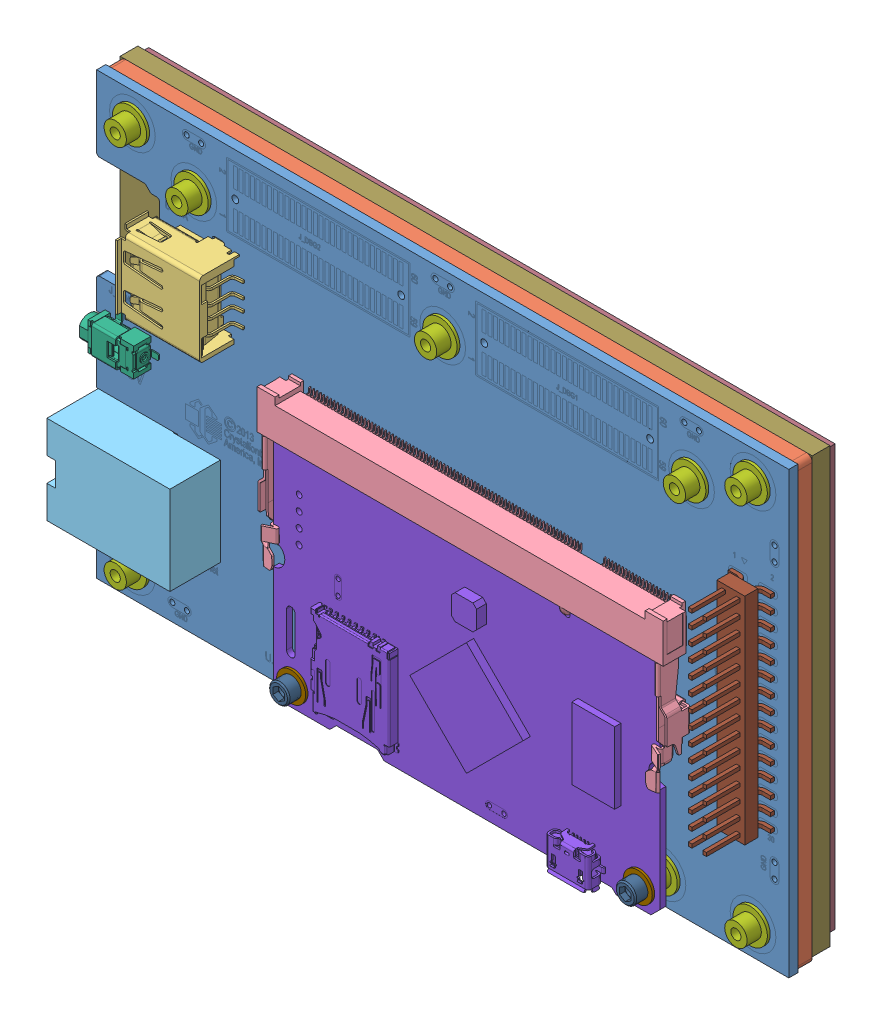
SolidWorks assembly CFA921_ASSY.SLDASM, configuration Default (file format 6000). Lengths in mm.
Overall size (121 77 18.23).
24 component instances, 13 part files, 54 mates.
Components (placement in the parent):
- cfa10058_pcb-1: cfa10058_pcb.SLDPRT [Default] at origin size (121 77 1.6)
- CFPN_01883_rubber_spacer-1: CFPN_01883_rubber_spacer.SLDPRT [Default] at (0 0 -2.5) size (121 77 2.5)
- 875832010blf-1: 875832010blf.SLDPRT [Default] at (-35.5 16.0095 8.288) x (0 1 0) z (1 0 0) size (14.5 10.32 14.91)
- c-1565917-4-d1-3d_sodimm_slot-1: c-1565917-4-d1-3d_sodimm_slot.SLDPRT [Default] at (8.25 2.4 4.32) x (1 0 0) z (0 -1 0) size (71.5 6.18 26.56)
- ethernet_jack-1: ethernet_jack.SLDPRT [Default] at (-49.6 -25.75 5.6002) x (-1 0 0) z (0 1 0) size (21.5 11.35 15.5)
- PJ-038-SMT_power_connector-1: PJ-038-SMT_power_connector.SLDPRT [Default] at (-58.9155 0 1.7) x (0 -1 0) z (-1 0 0) size (7.41 4 10.9)
- CFPN_01712-1: CFPN_01712.SLDPRT [Default] at (-54.25 -34 4.5999) x (-0.923728 -0.383049 0) z (0 0 -1) size (6 6 4.5)
- CFPN_01712-2: CFPN_01712.SLDPRT [Default] at (-43.5 28 4.5999) x (-0.923728 -0.383049 0) z (0 0 -1) size (6 6 4.5)
- CFPN_01712-3: CFPN_01712.SLDPRT [Default] at (54.25 33 4.5999) x (-0.923728 -0.383049 0) z (0 0 -1) size (6 6 4.5)
- CFPN_01712-4: CFPN_01712.SLDPRT [Default] at (43.5 28 4.5999) x (-0.923728 -0.383049 0) z (0 0 -1) size (6 6 4.5)
- CFPN_01712-5: CFPN_01712.SLDPRT [Default] at (0 28 4.5999) x (-0.923728 -0.383049 0) z (0 0 -1) size (6 6 4.5)
- CFPN_01712-6: CFPN_01712.SLDPRT [Default] at (-22 -34 4.5999) x (-0.923728 -0.383049 0) z (0 0 -1) size (6 6 4.5)
- CFPN_01712-7: CFPN_01712.SLDPRT [Default] at (54.25 -34 4.5999) x (-0.921184 -0.389128 0) z (0 0 -1) size (6 6 4.5)
- CFPN_01712-8: CFPN_01712.SLDPRT [Default] at (38.5 -34 4.5999) x (-0.992309 -0.123782 0) z (0 0 -1) size (6 6 4.5)
- CFPN_01712-9: CFPN_01712.SLDPRT [Default] at (-54.25 33 4.5999) x (-0.923728 -0.383049 0) z (0 0 -1) size (6 6 4.5)
- cfa10036-1: cfa10036.SLDPRT [Default] at (8.2 4.25 5.5999) x (-1 0 0) z (0 0 1) size (67.6 41.75 3.74)
- internal tooth-lock washers_ai-1: internal tooth-lock washers_ai.sldprt [Internal Tooth LW Type A-0.086] at (-22.1 -34 5.5999) x (1 0 0) z (0 -1 0) size (5.08 0.41 5.08)
- internal tooth-lock washers_ai-2: internal tooth-lock washers_ai.sldprt [Internal Tooth LW Type A-0.086] at (38.5 -34 5.5999) x (1 0 0) z (0 -1 0) size (5.08 0.41 5.08)
- socket head cap screw_ai-1: socket head cap screw_ai.sldprt [HX-SHCS 0.086-56x0.188x0.188-S] at (38.5 -34 8.1907) x (0 0 -1) z (1 0 0) size (6.96 3.56 3.56)
- socket head cap screw_ai-2: socket head cap screw_ai.sldprt [HX-SHCS 0.086-56x0.188x0.188-S] at (-22.1 -34 8.1907) x (0 0 -1) z (1 0 0) size (6.96 3.56 3.56)
- c-2-146134-1-n-3d_J_EXP_RE-MODELED-1: c-2-146134-1-n-3d_J_EXP_RE-MODELED.SLDPRT [Default] at (54.25 0.0001 5.4861) x (0 -1 0) z (0 0 -1) size (37.69 7.42 9.73)
- TFT_module-1: TFT_module.SLDASM [Default] at (43.3538 -65.1673 89.6451) x (-1 0 0) z (0 0 -1) size (121 75.85 4.4)
  - TFT_minus_touch_panel-1: TFT_minus_touch_panel.SLDPRT [Default] at (43.3538 65.2423 92.1451) size (121 75.85 3.1)
  - TFT_touch_panel-1: TFT_touch_panel.SLDPRT [Default] at (43.2538 65.8373 95.3451) size (120 73.5 1.2)
Mates (geometry in assembly coordinates):
- Coincident1: coincident aligned: plane of cfa10058_pcb-1 through (60.5 38 1.6) normal (0 1 0); plane of CFPN_01883_rubber_spacer-1 through (59.5 38 0) normal (0 1 0)
- Coincident2: coincident aligned: plane of cfa10058_pcb-1 through (-60.5 38 1.6) normal (-1 0 0); plane of CFPN_01883_rubber_spacer-1 through (-60.5 37 0) normal (-1 0 0)
- Coincident3: coincident anti-aligned: plane of cfa10058_pcb-1 through (-60 25.5 0) normal (0 0 -1); plane of CFPN_01883_rubber_spacer-1 through (59.5 37 0) normal (0 0 1)
- Coincident4: coincident anti-aligned: plane of cfa10058_pcb-1 through (-60 25.5 1.6) normal (0 0 1); plane of 875832010blf-1 through (-45.46 21.5095 1.6) normal (0 0 -1)
- Parallel1: parallel: line of cfa10058_pcb-1 through (60.5 -39 0) axis (0 1 0); plane of 875832010blf-1 through (-35.5 16.0095 8.288) normal (1 0 0)
- Coincident6: coincident aligned: plane of cfa10058_pcb-1 through (-49.5 23.5 1.6) normal (-1 0 0); plane of 875832010blf-1 through (-49.5 10.3995 2.868) normal (-1 0 0)
- Concentric1: concentric aligned: cylinder of cfa10058_pcb-1 through (41.65 4.25 1.6) axis (0 0 -1) radius 0.8; cylinder of c-1565917-4-d1-3d_sodimm_slot-1 through (41.65 4.25 1.6) axis (0 0 -1) radius 0.675
- Concentric2: concentric aligned: cylinder of cfa10058_pcb-1 through (-25.15 4.25 1.6) axis (0 0 -1) radius 0.55; cylinder of c-1565917-4-d1-3d_sodimm_slot-1 through (-25.15 4.25 1.6) axis (0 0 -1) radius 0.425
- Coincident7: coincident anti-aligned: plane of cfa10058_pcb-1 through (-60 25.5 1.6) normal (0 0 1); plane of c-1565917-4-d1-3d_sodimm_slot-1 through (-27.25 2.4 1.6) normal (0 0 -1)
- Parallel2: parallel aligned: plane of cfa10058_pcb-1 through (-60.5 -1.5 1.6) normal (-1 0 0); plane of ethernet_jack-1 through (-60.35 -10.25 10.45) normal (-1 0 0)
- Parallel3: parallel aligned: plane of cfa10058_pcb-1 through (-60 25.5 0) normal (0 0 -1); plane of ethernet_jack-1 through (-60.35 -10.25 -0.9) normal (0 0 -1)
- Concentric4: concentric anti-aligned: cylinder of cfa10058_pcb-1 through (-42.15 -14.5 1.6) axis (0 0 -1) radius 0.71; cylinder of ethernet_jack-1 through (-42.15 -14.5 0) axis (0 0 1) radius 0.55
- Coincident8: coincident anti-aligned: plane of cfa10058_pcb-1 through (-60 25.5 1.6) normal (0 0 1); plane of ethernet_jack-1 through (-47.15 -10.25 1.6) normal (0 0 -1)
- Parallel4: parallel aligned: plane of cfa10058_pcb-1 through (-60 25.5 1.6) normal (0 0 1); plane of PJ-038-SMT_power_connector-1 through (-53.7655 -2.24 5) normal (0 0 1)
- Parallel5: parallel anti-aligned: plane of cfa10058_pcb-1 through (-60.5 6.5 1.6) normal (-1 0 0); plane of PJ-038-SMT_power_connector-1 through (-50.9155 2.5 4.7) normal (1 0 0)
- Concentric5: concentric anti-aligned: cylinder of cfa10058_pcb-1 through (-52.9155 0 1.6) axis (0 0 -1) radius 0.65; cylinder of PJ-038-SMT_power_connector-1 through (-52.9155 0 1.7) axis (0 0 1) radius 0.6
- Coincident10: coincident anti-aligned: plane of cfa10058_pcb-1 through (-60 25.5 1.6) normal (0 0 1); plane of PJ-038-SMT_power_connector-1 through (-56.9155 2.17 1.6) normal (0 0 -1)
- Concentric6: concentric aligned: cylinder of cfa10058_pcb-1 through (-54.25 -34 1.6) axis (0 0 -1) radius 2.075; cylinder of CFPN_01712-1 through (-54.25 -34 1.5999) axis (0 0 -1) radius 1.95
- Coincident11: coincident anti-aligned: plane of cfa10058_pcb-1 through (-54.25 -34 1.5999) normal (0 0 1); plane of CFPN_01712-1 through (-54.25 -34 1.5999) normal (0 0 -1)
- Concentric7: concentric aligned: cylinder of cfa10058_pcb-1 through (-22 -34 1.6) axis (0 0 -1) radius 2.075; cylinder of CFPN_01712-6 through (-22 -34 1.5999) axis (0 0 -1) radius 1.95
- Coincident12: coincident anti-aligned: plane of cfa10058_pcb-1 through (-22 -34 1.5999) normal (0 0 1); plane of CFPN_01712-6 through (-22 -34 1.5999) normal (0 0 -1)
- Concentric8: concentric aligned: cylinder of cfa10058_pcb-1 through (38.5 -34 1.6) axis (0 0 -1) radius 2.075; cylinder of CFPN_01712-8 through (38.5 -34 1.5999) axis (0 0 -1) radius 1.95
- Coincident13: coincident anti-aligned: plane of cfa10058_pcb-1 through (38.5 -34 1.5999) normal (0 0 1); plane of CFPN_01712-8 through (38.5 -34 1.5999) normal (0 0 -1)
- Concentric9: concentric aligned: cylinder of cfa10058_pcb-1 through (54.25 -34 1.6) axis (0 0 -1) radius 2.075; cylinder of CFPN_01712-7 through (54.25 -34 1.5999) axis (0 0 -1) radius 1.95
- Coincident14: coincident anti-aligned: plane of cfa10058_pcb-1 through (54.25 -34 1.5999) normal (0 0 1); plane of CFPN_01712-7 through (54.25 -34 1.5999) normal (0 0 -1)
- Concentric10: concentric aligned: cylinder of cfa10058_pcb-1 through (-54.25 33 1.6) axis (0 0 -1) radius 2.075; cylinder of CFPN_01712-9 through (-54.25 33 1.5999) axis (0 0 -1) radius 1.95
- Coincident15: coincident anti-aligned: plane of cfa10058_pcb-1 through (-54.25 33 1.5999) normal (0 0 1); plane of CFPN_01712-9 through (-54.25 33 1.5999) normal (0 0 -1)
- Concentric11: concentric aligned: cylinder of cfa10058_pcb-1 through (-43.5 28 1.6) axis (0 0 -1) radius 2.075; cylinder of CFPN_01712-2 through (-43.5 28 1.5999) axis (0 0 -1) radius 1.95
- Concentric12: concentric aligned: cylinder of cfa10058_pcb-1 through (0 28 1.6) axis (0 0 -1) radius 2.075; cylinder of CFPN_01712-5 through (0 28 1.5999) axis (0 0 -1) radius 1.95
- Concentric13: concentric aligned: cylinder of cfa10058_pcb-1 through (43.5 28 1.6) axis (0 0 -1) radius 2.075; cylinder of CFPN_01712-4 through (43.5 28 1.5999) axis (0 0 -1) radius 1.95
- Concentric14: concentric aligned: cylinder of cfa10058_pcb-1 through (54.25 33 1.6) axis (0 0 -1) radius 2.075; cylinder of CFPN_01712-3 through (54.25 33 1.5999) axis (0 0 -1) radius 1.95
- Coincident16: coincident anti-aligned: plane of cfa10058_pcb-1 through (-43.5 28 1.5999) normal (0 0 1); plane of CFPN_01712-2 through (-43.5 28 1.5999) normal (0 0 -1)
- Coincident17: coincident anti-aligned: plane of cfa10058_pcb-1 through (0 28 1.5999) normal (0 0 1); plane of CFPN_01712-5 through (0 28 1.5999) normal (0 0 -1)
- Coincident18: coincident anti-aligned: plane of cfa10058_pcb-1 through (43.5 28 1.5999) normal (0 0 1); plane of CFPN_01712-4 through (43.5 28 1.5999) normal (0 0 -1)
- Coincident19: coincident anti-aligned: plane of cfa10058_pcb-1 through (54.25 33 1.5999) normal (0 0 1); plane of CFPN_01712-3 through (54.25 33 1.5999) normal (0 0 -1)
- Parallel6: parallel aligned: plane of cfa10036-1 through (-25.6 4.25 4.5999) normal (0 1 0); plane of c-1565917-4-d1-3d_sodimm_slot-1 through (-24.1 7.95 6.8) normal (0 1 0)
- Coincident20: coincident anti-aligned: plane of c-1565917-4-d1-3d_sodimm_slot-1 through (8.25 4.25 4.32) normal (0 -1 0); plane of cfa10036-1 through (-25.6 4.25 4.5999) normal (0 1 0)
- Concentric15: concentric aligned: cylinder of CFPN_01712-8 through (38.5 -34 4.5999) axis (0 0 1) radius 0.889; cylinder of cfa10036-1 through (38.5 -34 4.5999) axis (0 0 1) radius 1
- Coincident21: coincident anti-aligned: plane of CFPN_01712-8 through (38.5 -34 4.5999) normal (0 0 1); plane of cfa10036-1 through (-25.6 -15.75 4.5999) normal (0 0 -1)
- Concentric16: concentric anti-aligned: cylinder of cfa10036-1 through (-22.1 -34 4.5999) axis (0 0 1) radius 1; cylinder of internal tooth-lock washers_ai-1 through (-22.1 -34 6.0063) axis (0 0 -1) radius 2.54
- Coincident22: coincident anti-aligned: plane of cfa10036-1 through (-25.6 -15.75 5.5999) normal (0 0 1); plane of internal tooth-lock washers_ai-1 through (-22.1 -34 5.5999) normal (0 0 -1)
- Coincident23: coincident anti-aligned: plane of cfa10036-1 through (-25.6 -15.75 5.5999) normal (0 0 1); plane of internal tooth-lock washers_ai-2 through (38.5 -34 5.5999) normal (0 0 -1)
- Concentric17: concentric aligned: circle of cfa10036-1; circle of internal tooth-lock washers_ai-2
- Concentric18: concentric aligned: cylinder of cfa10036-1 through (-22.1 -34 4.5999) axis (0 0 1) radius 1; cylinder of socket head cap screw_ai-2 through (-22.1 -34 39.9407) axis (0 0 1) radius 1.778
- Concentric19: concentric aligned: cylinder of cfa10036-1 through (38.5 -34 4.5999) axis (0 0 1) radius 1; cylinder of socket head cap screw_ai-1 through (38.5 -34 39.9407) axis (0 0 1) radius 1.778
- Coincident24: coincident aligned: plane of internal tooth-lock washers_ai-1 through (-22.1 -34 6.0063) normal (0 0 1); circle of socket head cap screw_ai-2
- Coincident25: coincident anti-aligned: plane of internal tooth-lock washers_ai-2 through (38.5 -34 6.0063) normal (0 0 1); plane of socket head cap screw_ai-1 through (38.5 -32.222 6.0063) normal (0 0 -1)
- Coincident26: coincident anti-aligned: plane of cfa10058_pcb-1 through (57.9965 17.907 1.5999) normal (0 0 1); plane of c-2-146134-1-n-3d_J_EXP_RE-MODELED-1 through (50.5416 -18.0975 1.5999) normal (0 0 -1)
- Parallel7: parallel aligned: plane of cfa10058_pcb-1 through (60.5 38 1.6) normal (0 1 0); plane of c-2-146134-1-n-3d_J_EXP_RE-MODELED-1 through (51.8116 18.8469 3.2001) normal (0 1 0)
- Distance1: distance = 0.5461 mm: line of cfa10058_pcb-1 through (58.5045 17.653 1.6) axis (0 1 0); plane of c-2-146134-1-n-3d_J_EXP_RE-MODELED-1 through (57.9584 17.4625 2.2349) normal (1 0 0)
- Distance2: distance = 0.3175 mm: plane of c-2-146134-1-n-3d_J_EXP_RE-MODELED-1 through (56.4725 -18.0975 2.8699) normal (0 -1 0); line of cfa10058_pcb-1 through (55.7105 -18.415 1.6) axis (1 0 0)
- Coincident28: coincident anti-aligned: plane of CFPN_01883_rubber_spacer-1 through (59.5 37 -2.5) normal (0 0 -1); plane of TFT_module-1/TFT_minus_touch_panel-1 through (0 0.075 -2.5) normal (0 0 1)
- Coincident29: coincident: line of cfa10058_pcb-1 through (60.5 38 0) axis (-1 0 0); plane of TFT_module-1/TFT_minus_touch_panel-1 through (60.5 38 -5.6) normal (0 1 0)
- Coincident30: coincident aligned: plane of CFPN_01883_rubber_spacer-1 through (60.5 -38 0) normal (1 0 0); plane of TFT_module-1/TFT_minus_touch_panel-1 through (60.5 38 -5.6) normal (1 0 0)
